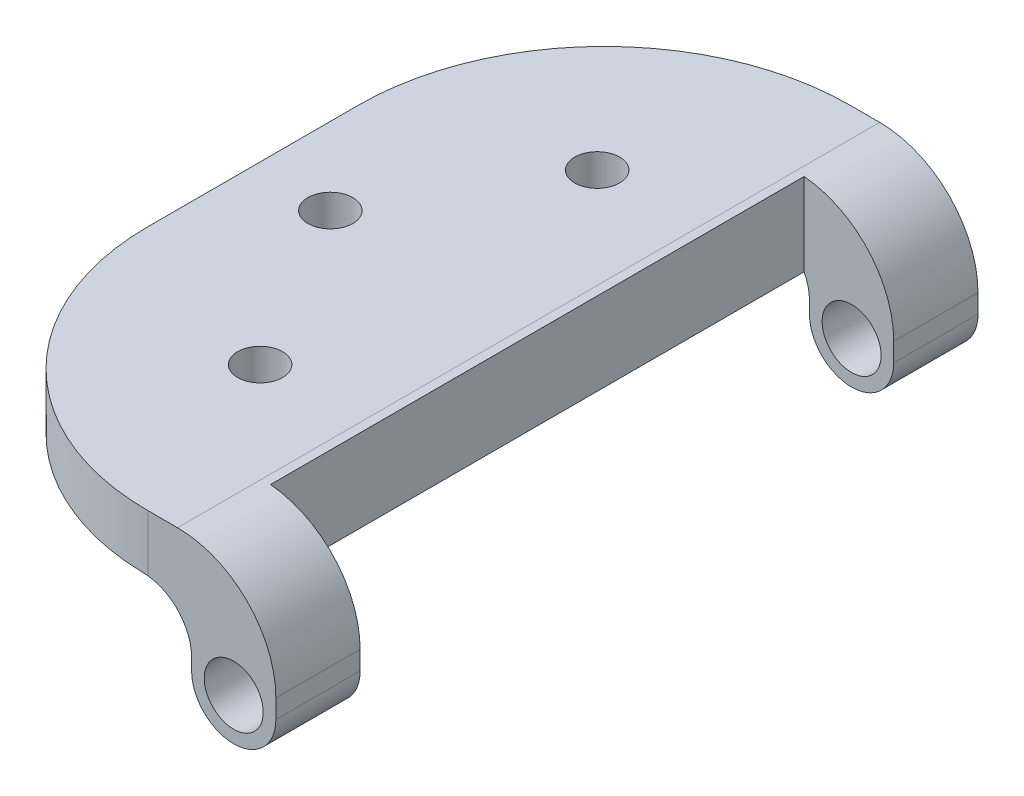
from build123d import *

# Parameters (mm, degrees)
SKETCH1_R                = 1.6
BOSS_EXTRUDE1_DEPTH      = 4
BOSS_EXTRUDE2_DEPTH      = 25
BOSS_EXTRUDE2_DEPTH_BACK = 25
SKETCH2_R                = 3
BOSS_EXTRUDE4_DEPTH      = 50
SKETCH11_R               = 2.1
CUT_EXTRUDE1_DEPTH       = 65
FILLET2_R                = 7
FILLET3_R                = 3.5
CUT_EXTRUDE2_DEPTH       = 65


with BuildPart() as part:
    # Sketch1 → Boss-Extrude1 (new body)
    with BuildSketch(Plane(origin=(0, 0, 0), x_dir=(1, 0, 0), z_dir=(0, 1, 0))):
        with BuildLine():
            Line((0, 18), (0, 25))
            ThreePointArc((0, 25), (-12.374368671, 19.874368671), (-17.5, 7.5))
            Line((-17.5, 7.5), (-17.5, 0))
            Line((-17.5, 0), (-17.5, -7.5))
            ThreePointArc((-17.5, -7.5), (-12.374368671, -19.874368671), (0, -25))
            Line((0, -25), (0, -18))
            Line((0, -18), (0, 0))
            Line((0, 0), (0, 18))
        make_face()
        with Locations(Location((-5, 12, 0), (0, 0, 270))):
            Circle(SKETCH1_R, mode=Mode.SUBTRACT)
        with Locations(Location((-5, -12, 0), (0, 0, 270))):
            Circle(SKETCH1_R, mode=Mode.SUBTRACT)
        with Locations(Location((-12, 0, 0), (0, 0, 270))):
            Circle(SKETCH1_R, mode=Mode.SUBTRACT)
    extrude(amount=BOSS_EXTRUDE1_DEPTH)



with BuildPart() as body_2:
    # Sketch2 → Boss-Extrude2 (new, two sides: drawn at the far end of the back side and taken through both)
    with BuildSketch(Plane.XY.offset(-BOSS_EXTRUDE2_DEPTH_BACK)):
        with Locations((6.12, -4.33)):
            Circle(SKETCH2_R)
    extrude(amount=BOSS_EXTRUDE2_DEPTH + BOSS_EXTRUDE2_DEPTH_BACK)


with BuildPart() as part_1:
    add(part.part)

    add(body_2.part)  # Boss-Extrude4 merges body 2
    # Sketch10 → Boss-Extrude4 (add)
    with BuildSketch(Plane.XY.offset(25)):
        with BuildLine():
            Line((3.12, -4.33), (3.12, 0))
            Line((3.12, 0), (0, 0))
            Line((0, 0), (0, 4))
            Line((0, 4), (9.12, 4))
            Line((9.12, 4), (9.12, -4.33))
            ThreePointArc((9.12, -4.33), (6.12, -7.33), (3.12, -4.33))
        make_face()
    extrude(amount=-BOSS_EXTRUDE4_DEPTH)

    # Sketch11 → Cut-Extrude1 (cut)
    with BuildSketch(Plane.XY.offset(25)):
        with Locations((6.12, -4.33)):
            Circle(SKETCH11_R)
    extrude(amount=-CUT_EXTRUDE1_DEPTH, mode=Mode.SUBTRACT)

    # Fillet2
    fillet2_edges = [part_1.edges().sort_by_distance(p)[0] for p in [
        (9.12, 4, 0),
    ]]
    fillet(fillet2_edges, radius=FILLET2_R)

    # Fillet3
    fillet3_edges = [part_1.edges().sort_by_distance(p)[0] for p in [
        (3.12, 0, 0),
    ]]
    fillet(fillet3_edges, radius=FILLET3_R)

    # Sketch9 → Cut-Extrude2 (cut)
    with BuildSketch(Plane(origin=(0, 4, 0), x_dir=(1, 0, 0), z_dir=(0, 1, 0))):
        Polygon((12.195462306, 0), (12.195462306, 19), (2.738585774, 19), (2.738585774, -19), (12.195462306, -19), align=None)
    extrude(amount=-CUT_EXTRUDE2_DEPTH, mode=Mode.SUBTRACT)


solid = part_1.part
